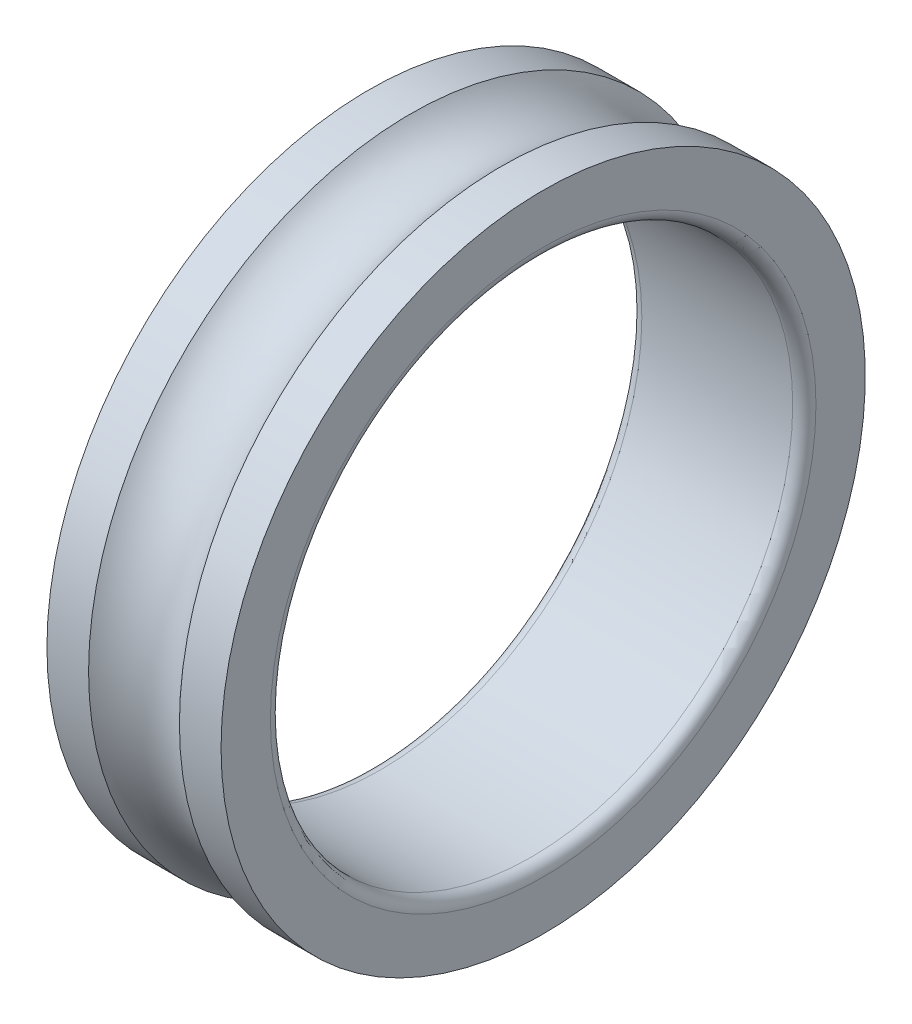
from build123d import *


with BuildPart() as part:
    # Esquisse1 → Base-R_volution (revolve)
    with BuildSketch(Plane(origin=(0, 0, 0), x_dir=(1, 0, 0), z_dir=(0, 1, 0)), mode=Mode.PRIVATE) as base_r_volution_sk:
        with BuildLine():
            Line((0, 55.5), (0, 47))
            ThreePointArc((0, 47), (0.585786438, 45.585786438), (2, 45))
            Line((2, 45), (28, 45))
            ThreePointArc((28, 45), (29.414213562, 45.585786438), (30, 47))
            Line((30, 47), (30, 55.5))
            Line((30, 55.5), (22.826237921, 55.5))
            ThreePointArc((22.826237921, 55.5), (15, 52), (7.173762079, 55.5))
            Line((7.173762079, 55.5), (0, 55.5))
        make_face()
    revolve(base_r_volution_sk.sketch.rotate(Axis((0, 0, 0), (1, 0, 0)), 180), axis=Axis((0, 0, 0), (1, 0, 0)))


solid = part.part
